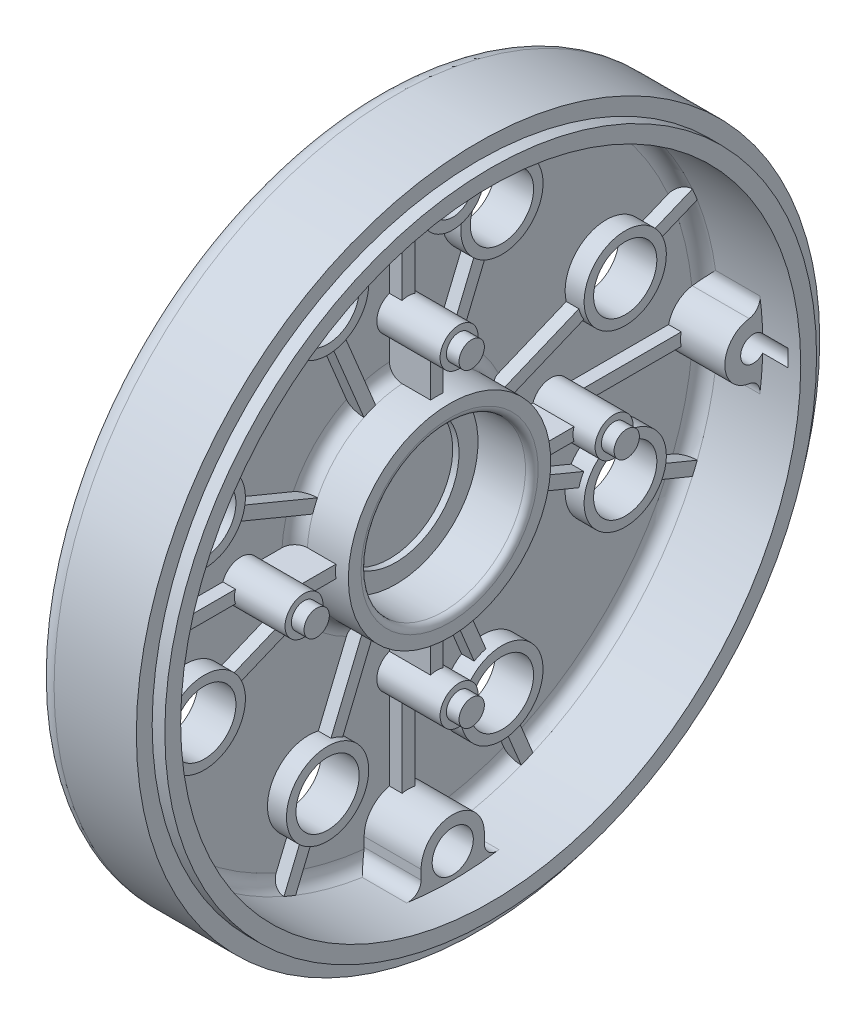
from build123d import *

# Parameters (mm, degrees)
EXTRUSION1_REACH             = 79.305
ESQUISSE3_R                  = 3.25
ENL_V_MAT_EXTRU_1_DEPTH      = 78.30459243
R_P_TITION_CIRCULAIRE1_COUNT = 2
EXTRUSION2_START             = -9.000004
EXTRUSION2_DEPTH             = 9.000004
ESQUISSE7_W                  = 2
ESQUISSE7_H                  = 16
R_P_TITION_CIRCULAIRE2_COUNT = 2
NERVURE1_REACH               = 79.466
ESQUISSE9_R                  = 6.5
EXTRUSION3_DEPTH             = 3
ESQUISSE10_R                 = 5
ENL_V_MAT_EXTRU_2_DEPTH      = 78.30459243
R_P_TITION_CIRCULAIRE3_COUNT = 8
NERVURE2_REACH               = 79.466
ESQUISSE12_WALLS_W           = 2
ESQUISSE12_WALLS_H           = 180.932243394
ESQUISSE12_WALLS_W_2         = 183.932243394
ESQUISSE12_WALLS_H_2         = 2
ESQUISSE13_R                 = 3
EXTRUSION4_DEPTH             = 10
ESQUISSE14_R                 = 2
EXTRUSION5_DEPTH             = 2
R_P_TITION_CIRCULAIRE4_COUNT = 4
NERVURE3_REACH               = 78.956
ESQUISSE15_WALLS_W           = 2
ESQUISSE15_WALLS_H           = 161.412312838
ESQUISSE15_WALLS_W_2         = 161.412312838
ESQUISSE15_WALLS_H_2         = 2


with BuildPart() as part:
    # Esquisse1 → R_volution1 (revolve)
    with BuildSketch(Plane.XY, mode=Mode.PRIVATE) as r_volution1_sk:
        with BuildLine():
            Line((0, 0), (0, 51))
            ThreePointArc((0, 51), (0.878679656, 53.121320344), (3, 54))
            Line((3, 54), (16, 54))
            Line((16, 54), (16, 51.5))
            Line((16, 51.5), (18, 51.5))
            Line((18, 51.5), (18, 49))
            Line((18, 49), (5, 49))
            ThreePointArc((5, 49), (3.585786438, 48.414213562), (3, 47))
            Line((3, 47), (3, 18))
            ThreePointArc((3, 18), (3.585786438, 16.585786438), (5, 16))
            Line((5, 16), (11.5, 16))
            Line((11.5, 16), (11.5, 14))
            ThreePointArc((11.5, 14), (11.207106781, 13.292893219), (10.5, 13))
            Line((10.5, 13), (3, 13))
            Line((3, 13), (3, 10))
            Line((3, 10), (2, 10))
            Line((2, 10), (2, 0))
            Line((2, 0), (0, 0))
        make_face()
    revolve(r_volution1_sk.sketch.rotate(Axis((0, 0, 0), (1, 0, 0)), 90), axis=Axis((0, 0, 0), (1, 0, 0)))

    # Extrusion1: up to this face of the body (flat: up to its plane)
    extrusion1_end = Plane(part.part.faces().sort_by_distance((3, 0, -45.670639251))[0])
    # Esquisse2 → Extrusion1 (add, up to the picked face)
    with BuildSketch(Plane(origin=(12, 0, 0), x_dir=(0, 0, -1), z_dir=(1, 0, 0)), mode=Mode.PRIVATE) as extrusion1_sk1:
        with BuildLine():
            Line((-5, 45), (-5, 46.475800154))
            ThreePointArc((-5, 46.475800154), (-5.695343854, 47.991673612), (-7.29787234, 48.453493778))
            ThreePointArc((-7.29787234, 48.453493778), (0, 49), (7.29787234, 48.453493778))
            ThreePointArc((7.29787234, 48.453493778), (5.695343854, 47.991673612), (5, 46.475800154))
            Line((5, 46.475800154), (5, 45))
            ThreePointArc((5, 45), (0, 40), (-5, 45))
        make_face()
    extrusion1_tool1 = split(extrude(extrusion1_sk1.sketch, amount=-EXTRUSION1_REACH, mode=Mode.PRIVATE), bisect_by=extrusion1_end, keep=Keep.BOTH, mode=Mode.PRIVATE)
    extrusion1 = extrusion1_tool1.solids().sort_by(Axis((12, 45.008794, 0), (-1, 0, 0)))[0]
    add(extrusion1)

    # Esquisse3 → Enl_v. mat.-Extru.1 (cut, through all)
    with BuildSketch(Plane(origin=(12, 0, 0), x_dir=(0, 0, -1), z_dir=(1, 0, 0))):
        with Locations((0, 45)):
            Circle(ESQUISSE3_R)
    enl_v_mat_extru_1 = extrude(amount=-ENL_V_MAT_EXTRU_1_DEPTH, mode=Mode.SUBTRACT)

    # R_p_tition circulaire1: Extrusion1, Enl_v. mat.-Extru.1 ×2 about axis
    r_p_tition_circulaire1_axis = Axis((0, 0, 0), (1, 0, 0))
    add([extrusion1.rotate(r_p_tition_circulaire1_axis, i * 360 / R_P_TITION_CIRCULAIRE1_COUNT) for i in range(1, R_P_TITION_CIRCULAIRE1_COUNT)])
    add([enl_v_mat_extru_1.rotate(r_p_tition_circulaire1_axis, i * 360 / R_P_TITION_CIRCULAIRE1_COUNT) for i in range(1, R_P_TITION_CIRCULAIRE1_COUNT)], mode=Mode.SUBTRACT)

    # Esquisse4 → Extrusion2 (add)
    with BuildSketch(Plane(origin=(12, 0, 0), x_dir=(0, 0, -1), z_dir=(1, 0, 0)).offset(EXTRUSION2_START)):
        with BuildLine():
            ThreePointArc((-46.847773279, -4.452482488), (-43, 0), (-46.847773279, 4.452482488))
            ThreePointArc((-46.847773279, 4.452482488), (-48.157249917, 5.230504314), (-48.539081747, 6.70503864))
            ThreePointArc((-48.539081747, 6.70503864), (-49, 0), (-48.539081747, -6.70503864))
            ThreePointArc((-48.539081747, -6.70503864), (-48.157249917, -5.230504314), (-46.847773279, -4.452482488))
        make_face()
    extrusion2 = extrude(amount=EXTRUSION2_DEPTH)

    # Esquisse7 → Trou taraud_ M51 (revolve, cut)
    with BuildSketch(Plane(origin=(16, 0, 47.5), x_dir=(0, 0, -1), z_dir=(0, 1, 0))):
        with Locations((1, 8)):
            Rectangle(ESQUISSE7_W, ESQUISSE7_H)
    trou_taraud_m51 = revolve(axis=Axis((22.35, 0, 47.5), (-1, 0, 0)), mode=Mode.SUBTRACT)

    # R_p_tition circulaire2: Extrusion2, Trou taraud_ M51 ×2 about axis
    r_p_tition_circulaire2_axis = Axis((0, 0, 0), (1, 0, 0))
    add([extrusion2.rotate(r_p_tition_circulaire2_axis, i * 360 / R_P_TITION_CIRCULAIRE2_COUNT) for i in range(1, R_P_TITION_CIRCULAIRE2_COUNT)])
    add([trou_taraud_m51.rotate(r_p_tition_circulaire2_axis, i * 360 / R_P_TITION_CIRCULAIRE2_COUNT) for i in range(1, R_P_TITION_CIRCULAIRE2_COUNT)], mode=Mode.SUBTRACT)

    # Esquisse11 walls → Nervure1 (add, up to next)
    with BuildSketch(Plane(origin=(5, 0, 0), x_dir=(0, 0, -1), z_dir=(1, 0, 0)), mode=Mode.PRIVATE) as nervure1_sk1:
        Polygon((-49.703052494, 117.380657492), (22.980870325, -58.093854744), (24.82862939, -57.328487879), (-47.855293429, 118.146024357), align=None)
    nervure1_tool1 = extrude(nervure1_sk1.sketch, amount=-NERVURE1_REACH, mode=Mode.PRIVATE) - part.part
    # Esquisse11 walls → Nervure1 (add, up to next)
    with BuildSketch(Plane(origin=(5, 0, 0), x_dir=(0, 0, -1), z_dir=(1, 0, 0)), mode=Mode.PRIVATE) as nervure1_sk2:
        Polygon((47.855293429, 118.146024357), (-24.82862939, -57.328487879), (-22.980870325, -58.093854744), (49.703052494, 117.380657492), align=None)
    nervure1_tool2 = extrude(nervure1_sk2.sketch, amount=-NERVURE1_REACH, mode=Mode.PRIVATE) - part.part
    # Esquisse11 walls → Nervure1 (add, up to next)
    with BuildSketch(Plane(origin=(5, 0, 0), x_dir=(0, 0, -1), z_dir=(1, 0, 0)), mode=Mode.PRIVATE) as nervure1_sk3:
        Polygon((117.380657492, 49.703052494), (-58.093854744, -22.980870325), (-57.328487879, -24.82862939), (118.146024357, 47.855293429), align=None)
    nervure1_tool3 = extrude(nervure1_sk3.sketch, amount=-NERVURE1_REACH, mode=Mode.PRIVATE) - part.part
    # Esquisse11 walls → Nervure1 (add, up to next)
    with BuildSketch(Plane(origin=(5, 0, 0), x_dir=(0, 0, -1), z_dir=(1, 0, 0)), mode=Mode.PRIVATE) as nervure1_sk4:
        Polygon((118.146024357, -47.855293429), (-57.328487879, 24.82862939), (-58.093854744, 22.980870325), (117.380657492, -49.703052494), align=None)
    nervure1_tool4 = extrude(nervure1_sk4.sketch, amount=-NERVURE1_REACH, mode=Mode.PRIVATE) - part.part
    # Esquisse11 walls → Nervure1 (add, up to next)
    with BuildSketch(Plane(origin=(5, 0, 0), x_dir=(0, 0, -1), z_dir=(1, 0, 0)), mode=Mode.PRIVATE) as nervure1_sk5:
        Polygon((49.703052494, -117.380657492), (-22.980870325, 58.093854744), (-24.82862939, 57.328487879), (47.855293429, -118.146024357), align=None)
    nervure1_tool5 = extrude(nervure1_sk5.sketch, amount=-NERVURE1_REACH, mode=Mode.PRIVATE) - part.part
    # Esquisse11 walls → Nervure1 (add, up to next)
    with BuildSketch(Plane(origin=(5, 0, 0), x_dir=(0, 0, -1), z_dir=(1, 0, 0)), mode=Mode.PRIVATE) as nervure1_sk6:
        Polygon((-47.855293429, -118.146024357), (24.82862939, 57.328487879), (22.980870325, 58.093854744), (-49.703052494, -117.380657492), align=None)
    nervure1_tool6 = extrude(nervure1_sk6.sketch, amount=-NERVURE1_REACH, mode=Mode.PRIVATE) - part.part
    # Esquisse11 walls → Nervure1 (add, up to next)
    with BuildSketch(Plane(origin=(5, 0, 0), x_dir=(0, 0, -1), z_dir=(1, 0, 0)), mode=Mode.PRIVATE) as nervure1_sk7:
        Polygon((-117.380657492, -49.703052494), (58.093854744, 22.980870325), (57.328487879, 24.82862939), (-118.146024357, -47.855293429), align=None)
    nervure1_tool7 = extrude(nervure1_sk7.sketch, amount=-NERVURE1_REACH, mode=Mode.PRIVATE) - part.part
    # Esquisse11 walls → Nervure1 (add, up to next)
    with BuildSketch(Plane(origin=(5, 0, 0), x_dir=(0, 0, -1), z_dir=(1, 0, 0)), mode=Mode.PRIVATE) as nervure1_sk8:
        Polygon((-118.146024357, 47.855293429), (57.328487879, -24.82862939), (58.093854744, -22.980870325), (-117.380657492, 49.703052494), align=None)
    nervure1_tool8 = extrude(nervure1_sk8.sketch, amount=-NERVURE1_REACH, mode=Mode.PRIVATE) - part.part
    add(nervure1_tool1.solids().sort_by_distance((5, 30.026084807, 12.437211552))[0])
    add(nervure1_tool2.solids().sort_by_distance((5, 30.026084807, -12.437211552))[0])
    add(nervure1_tool3.solids().sort_by_distance((5, 12.437211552, -30.026084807))[0])
    add(nervure1_tool4.solids().sort_by_distance((5, -12.437211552, -30.026084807))[0])
    add(nervure1_tool5.solids().sort_by_distance((5, -30.026084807, -12.437211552))[0])
    add(nervure1_tool6.solids().sort_by_distance((5, -30.026084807, 12.437211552))[0])
    add(nervure1_tool7.solids().sort_by_distance((5, -12.437211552, 30.026084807))[0])
    add(nervure1_tool8.solids().sort_by_distance((5, 12.437211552, 30.026084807))[0])

    # Esquisse9 → Extrusion3 (add)
    with BuildSketch(Plane(origin=(3, 0, 0), x_dir=(0, 0, -1), z_dir=(1, 0, 0))):
        with Locations(Location((-13.776603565, 33.25966317, 0), (0, 0, 121.349883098))):
            Circle(ESQUISSE9_R)
    extrusion3 = extrude(amount=EXTRUSION3_DEPTH)

    # Esquisse10 → Enl_v. mat.-Extru.2 (cut, through all)
    with BuildSketch(Plane(origin=(6, 0, 0), x_dir=(0, 0, -1), z_dir=(1, 0, 0))):
        with Locations((-13.776603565, 33.25966317)):
            Circle(ESQUISSE10_R)
    enl_v_mat_extru_2 = extrude(amount=-ENL_V_MAT_EXTRU_2_DEPTH, mode=Mode.SUBTRACT)

    # R_p_tition circulaire3: Extrusion3, Enl_v. mat.-Extru.2 ×8 about axis
    r_p_tition_circulaire3_axis = Axis((0, 0, 0), (1, 0, 0))
    add([extrusion3.rotate(r_p_tition_circulaire3_axis, i * 360 / R_P_TITION_CIRCULAIRE3_COUNT) for i in range(1, R_P_TITION_CIRCULAIRE3_COUNT)])
    add([enl_v_mat_extru_2.rotate(r_p_tition_circulaire3_axis, i * 360 / R_P_TITION_CIRCULAIRE3_COUNT) for i in range(1, R_P_TITION_CIRCULAIRE3_COUNT)], mode=Mode.SUBTRACT)

    # Esquisse12 walls → Nervure2 (add, up to next)
    with BuildSketch(Plane(origin=(5, 0, 0), x_dir=(0, 0, -1), z_dir=(1, 0, 0)), mode=Mode.PRIVATE) as nervure2_sk1:
        with Locations((0, 28)):
            Rectangle(ESQUISSE12_WALLS_W, ESQUISSE12_WALLS_H)
    nervure2_tool1 = extrude(nervure2_sk1.sketch, amount=-NERVURE2_REACH, mode=Mode.PRIVATE) - part.part
    # Esquisse12 walls → Nervure2 (add, up to next)
    with BuildSketch(Plane(origin=(5, 0, 0), x_dir=(0, 0, -1), z_dir=(1, 0, 0)), mode=Mode.PRIVATE) as nervure2_sk2:
        with Locations((-29.5, 0)):
            Rectangle(ESQUISSE12_WALLS_W_2, ESQUISSE12_WALLS_H_2)
    nervure2_tool2 = extrude(nervure2_sk2.sketch, amount=-NERVURE2_REACH, mode=Mode.PRIVATE) - part.part
    # Esquisse12 walls → Nervure2 (add, up to next)
    with BuildSketch(Plane(origin=(5, 0, 0), x_dir=(0, 0, -1), z_dir=(1, 0, 0)), mode=Mode.PRIVATE) as nervure2_sk3:
        with Locations((0, -28)):
            Rectangle(ESQUISSE12_WALLS_W, ESQUISSE12_WALLS_H)
    nervure2_tool3 = extrude(nervure2_sk3.sketch, amount=-NERVURE2_REACH, mode=Mode.PRIVATE) - part.part
    # Esquisse12 walls → Nervure2 (add, up to next)
    with BuildSketch(Plane(origin=(5, 0, 0), x_dir=(0, 0, -1), z_dir=(1, 0, 0)), mode=Mode.PRIVATE) as nervure2_sk4:
        with Locations((29.5, 0)):
            Rectangle(ESQUISSE12_WALLS_W_2, ESQUISSE12_WALLS_H_2)
    nervure2_tool4 = extrude(nervure2_sk4.sketch, amount=-NERVURE2_REACH, mode=Mode.PRIVATE) - part.part
    add(nervure2_tool1.solids().sort_by_distance((5, 28, 0))[0])
    add(nervure2_tool2.solids().sort_by_distance((5, 0, 29.5))[0])
    add(nervure2_tool3.solids().sort_by_distance((5, -28, 0))[0])
    add(nervure2_tool4.solids().sort_by_distance((5, 0, -29.5))[0])

    # Esquisse13 → Extrusion4 (add)
    with BuildSketch(Plane(origin=(3, 0, 0), x_dir=(0, 0, -1), z_dir=(1, 0, 0))):
        with Locations(Location((0, 24.5, 0), (0, 0, 109.471220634))):
            Circle(ESQUISSE13_R)
    extrusion4 = extrude(amount=EXTRUSION4_DEPTH)

    # Esquisse14 → Extrusion5 (add)
    with BuildSketch(Plane(origin=(13, 0, 0), x_dir=(0, 0, -1), z_dir=(1, 0, 0))):
        with Locations((0, 24.5)):
            Circle(ESQUISSE14_R)
    extrusion5 = extrude(amount=EXTRUSION5_DEPTH)

    # R_p_tition circulaire4: Extrusion4, Extrusion5 ×4 about axis
    r_p_tition_circulaire4_axis = Axis((0, 0, 0), (1, 0, 0))
    add([extrusion4.rotate(r_p_tition_circulaire4_axis, i * 360 / R_P_TITION_CIRCULAIRE4_COUNT) for i in range(1, R_P_TITION_CIRCULAIRE4_COUNT)])
    add([extrusion5.rotate(r_p_tition_circulaire4_axis, i * 360 / R_P_TITION_CIRCULAIRE4_COUNT) for i in range(1, R_P_TITION_CIRCULAIRE4_COUNT)])

    # Esquisse15 walls → Nervure3 (add, up to next)
    with BuildSketch(Plane(origin=(9.5, 0, 0), x_dir=(0, 0, -1), z_dir=(1, 0, 0)), mode=Mode.PRIVATE) as nervure3_sk1:
        with Locations((0, 18.75)):
            Rectangle(ESQUISSE15_WALLS_W, ESQUISSE15_WALLS_H)
    nervure3_tool1 = extrude(nervure3_sk1.sketch, amount=-NERVURE3_REACH, mode=Mode.PRIVATE) - part.part
    # Esquisse15 walls → Nervure3 (add, up to next)
    with BuildSketch(Plane(origin=(9.5, 0, 0), x_dir=(0, 0, -1), z_dir=(1, 0, 0)), mode=Mode.PRIVATE) as nervure3_sk2:
        with Locations((-18.75, 0)):
            Rectangle(ESQUISSE15_WALLS_W_2, ESQUISSE15_WALLS_H_2)
    nervure3_tool2 = extrude(nervure3_sk2.sketch, amount=-NERVURE3_REACH, mode=Mode.PRIVATE) - part.part
    # Esquisse15 walls → Nervure3 (add, up to next)
    with BuildSketch(Plane(origin=(9.5, 0, 0), x_dir=(0, 0, -1), z_dir=(1, 0, 0)), mode=Mode.PRIVATE) as nervure3_sk3:
        with Locations((0, -18.75)):
            Rectangle(ESQUISSE15_WALLS_W, ESQUISSE15_WALLS_H)
    nervure3_tool3 = extrude(nervure3_sk3.sketch, amount=-NERVURE3_REACH, mode=Mode.PRIVATE) - part.part
    # Esquisse15 walls → Nervure3 (add, up to next)
    with BuildSketch(Plane(origin=(9.5, 0, 0), x_dir=(0, 0, -1), z_dir=(1, 0, 0)), mode=Mode.PRIVATE) as nervure3_sk4:
        with Locations((18.75, 0)):
            Rectangle(ESQUISSE15_WALLS_W_2, ESQUISSE15_WALLS_H_2)
    nervure3_tool4 = extrude(nervure3_sk4.sketch, amount=-NERVURE3_REACH, mode=Mode.PRIVATE) - part.part
    add(nervure3_tool1.solids().sort_by_distance((9.5, 18.75, 0))[0])
    add(nervure3_tool2.solids().sort_by_distance((9.5, 0, 18.75))[0])
    add(nervure3_tool3.solids().sort_by_distance((9.5, -18.75, 0))[0])
    add(nervure3_tool4.solids().sort_by_distance((9.5, 0, -18.75))[0])


solid = part.part
